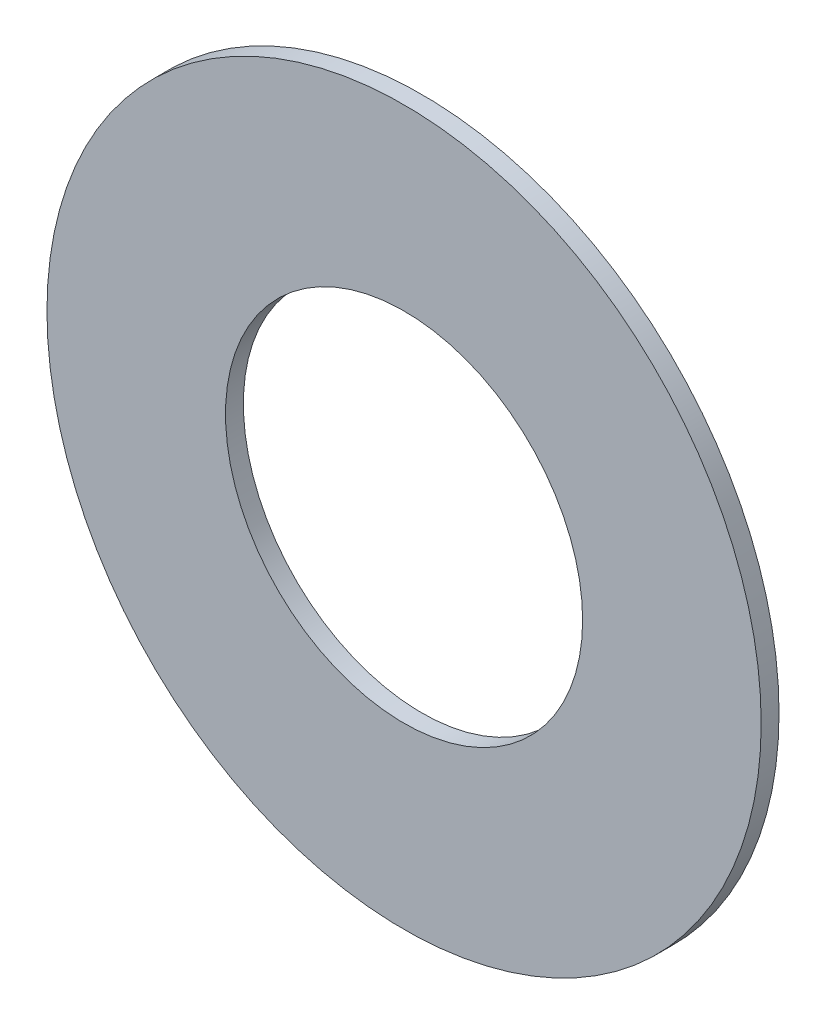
ISO-10303-21;
HEADER;
FILE_DESCRIPTION(('STEP AP214'),'2;1');
FILE_NAME('part.step','',(''),(''),'','','');
FILE_SCHEMA(('AUTOMOTIVE_DESIGN { 1 0 10303 214 1 1 1 1 }'));
ENDSEC;
DATA;
#1=APPLICATION_CONTEXT('core data for automotive mechanical design processes');
#2=APPLICATION_PROTOCOL_DEFINITION('international standard','automotive_design',2000,#1);
#3=PRODUCT_CONTEXT('',#1,'mechanical');
#4=PRODUCT('Part','Part','',(#3));
#5=PRODUCT_RELATED_PRODUCT_CATEGORY('part','',(#4));
#6=PRODUCT_DEFINITION_FORMATION('','',#4);
#7=PRODUCT_DEFINITION_CONTEXT('part definition',#1,'design');
#8=PRODUCT_DEFINITION('design','',#6,#7);
#9=PRODUCT_DEFINITION_SHAPE('','',#8);
#10=(LENGTH_UNIT() NAMED_UNIT(*) SI_UNIT(.MILLI.,.METRE.));
#11=(NAMED_UNIT(*) PLANE_ANGLE_UNIT() SI_UNIT($,.RADIAN.));
#12=(NAMED_UNIT(*) SI_UNIT($,.STERADIAN.) SOLID_ANGLE_UNIT());
#13=UNCERTAINTY_MEASURE_WITH_UNIT(LENGTH_MEASURE(1.E-05),#10,'distance_accuracy_value','');
#14=(GEOMETRIC_REPRESENTATION_CONTEXT(3) GLOBAL_UNCERTAINTY_ASSIGNED_CONTEXT((#13)) GLOBAL_UNIT_ASSIGNED_CONTEXT((#10,
#11,#12)) REPRESENTATION_CONTEXT('',''));
#15=CARTESIAN_POINT('',(0.,0.,0.));
#16=DIRECTION('',(0.,0.,1.));
#17=DIRECTION('',(1.,0.,0.));
#18=AXIS2_PLACEMENT_3D('',#15,#16,#17);
#19=CARTESIAN_POINT('',(0.,0.,0.25));
#20=DIRECTION('',(0.,0.,1.));
#21=DIRECTION('',(1.,0.,0.));
#22=AXIS2_PLACEMENT_3D('',#19,#20,#21);
#23=PLANE('',#22);
#24=CARTESIAN_POINT('',(0.,0.,0.25));
#25=DIRECTION('',(0.,0.,1.));
#26=DIRECTION('',(1.,0.,0.));
#27=AXIS2_PLACEMENT_3D('',#24,#25,#26);
#28=CIRCLE('',#27,10.);
#29=CARTESIAN_POINT('',(10.,0.,0.25));
#30=VERTEX_POINT('',#29);
#31=EDGE_CURVE('E10',#30,#30,#28,.T.);
#32=ORIENTED_EDGE('',*,*,#31,.T.);
#33=EDGE_LOOP('',(#32));
#34=FACE_BOUND('',#33,.T.);
#35=CARTESIAN_POINT('',(0.,0.,0.25));
#36=DIRECTION('',(0.,0.,1.));
#37=DIRECTION('',(1.,0.,0.));
#38=AXIS2_PLACEMENT_3D('',#35,#36,#37);
#39=CIRCLE('',#38,5.);
#40=CARTESIAN_POINT('',(5.,0.,0.25));
#41=VERTEX_POINT('',#40);
#42=EDGE_CURVE('E45',#41,#41,#39,.T.);
#43=ORIENTED_EDGE('',*,*,#42,.F.);
#44=EDGE_LOOP('',(#43));
#45=FACE_BOUND('',#44,.T.);
#46=ADVANCED_FACE('F34',(#34,#45),#23,.T.);
#47=CARTESIAN_POINT('',(0.,0.,-0.25));
#48=DIRECTION('',(0.,0.,1.));
#49=DIRECTION('',(1.,0.,0.));
#50=AXIS2_PLACEMENT_3D('',#47,#48,#49);
#51=PLANE('',#50);
#52=CARTESIAN_POINT('',(0.,0.,-0.25));
#53=DIRECTION('',(0.,0.,1.));
#54=DIRECTION('',(1.,0.,0.));
#55=AXIS2_PLACEMENT_3D('',#52,#53,#54);
#56=CIRCLE('',#55,10.);
#57=CARTESIAN_POINT('',(10.,0.,-0.25));
#58=VERTEX_POINT('',#57);
#59=EDGE_CURVE('E41',#58,#58,#56,.T.);
#60=ORIENTED_EDGE('',*,*,#59,.F.);
#61=EDGE_LOOP('',(#60));
#62=FACE_BOUND('',#61,.T.);
#63=CARTESIAN_POINT('',(0.,0.,-0.25));
#64=DIRECTION('',(0.,0.,1.));
#65=DIRECTION('',(1.,0.,0.));
#66=AXIS2_PLACEMENT_3D('',#63,#64,#65);
#67=CIRCLE('',#66,5.);
#68=CARTESIAN_POINT('',(5.,0.,-0.25));
#69=VERTEX_POINT('',#68);
#70=EDGE_CURVE('E49',#69,#69,#67,.T.);
#71=ORIENTED_EDGE('',*,*,#70,.T.);
#72=EDGE_LOOP('',(#71));
#73=FACE_BOUND('',#72,.T.);
#74=ADVANCED_FACE('F55',(#62,#73),#51,.F.);
#75=CARTESIAN_POINT('',(0.,0.,0.25));
#76=DIRECTION('',(0.,0.,-1.));
#77=DIRECTION('',(-1.,0.,0.));
#78=AXIS2_PLACEMENT_3D('',#75,#76,#77);
#79=CYLINDRICAL_SURFACE('',#78,10.);
#80=ORIENTED_EDGE('',*,*,#31,.F.);
#81=EDGE_LOOP('',(#80));
#82=FACE_BOUND('',#81,.T.);
#83=ORIENTED_EDGE('',*,*,#59,.T.);
#84=EDGE_LOOP('',(#83));
#85=FACE_BOUND('',#84,.T.);
#86=ADVANCED_FACE('F36',(#82,#85),#79,.T.);
#87=CARTESIAN_POINT('',(0.,0.,0.25));
#88=DIRECTION('',(0.,0.,-1.));
#89=DIRECTION('',(-1.,0.,0.));
#90=AXIS2_PLACEMENT_3D('',#87,#88,#89);
#91=CYLINDRICAL_SURFACE('',#90,5.);
#92=ORIENTED_EDGE('',*,*,#42,.T.);
#93=EDGE_LOOP('',(#92));
#94=FACE_BOUND('',#93,.T.);
#95=ORIENTED_EDGE('',*,*,#70,.F.);
#96=EDGE_LOOP('',(#95));
#97=FACE_BOUND('',#96,.T.);
#98=ADVANCED_FACE('F57',(#94,#97),#91,.F.);
#99=CLOSED_SHELL('',(#46,#74,#86,#98));
#100=MANIFOLD_SOLID_BREP('B2',#99);
#101=ADVANCED_BREP_SHAPE_REPRESENTATION('',(#18,#100),#14);
#102=SHAPE_DEFINITION_REPRESENTATION(#9,#101);
ENDSEC;
END-ISO-10303-21;
